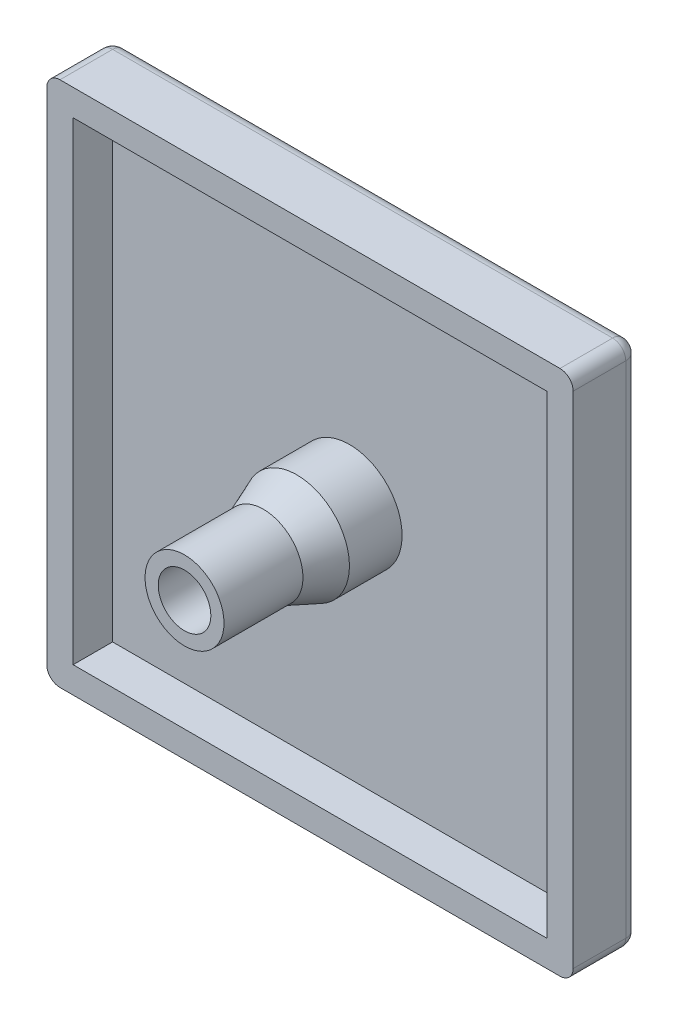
ISO-10303-21;
HEADER;
FILE_DESCRIPTION(('STEP AP214'),'2;1');
FILE_NAME('part.step','',(''),(''),'','','');
FILE_SCHEMA(('AUTOMOTIVE_DESIGN { 1 0 10303 214 1 1 1 1 }'));
ENDSEC;
DATA;
#1=APPLICATION_CONTEXT('core data for automotive mechanical design processes');
#2=APPLICATION_PROTOCOL_DEFINITION('international standard','automotive_design',2000,#1);
#3=PRODUCT_CONTEXT('',#1,'mechanical');
#4=PRODUCT('Part','Part','',(#3));
#5=PRODUCT_RELATED_PRODUCT_CATEGORY('part','',(#4));
#6=PRODUCT_DEFINITION_FORMATION('','',#4);
#7=PRODUCT_DEFINITION_CONTEXT('part definition',#1,'design');
#8=PRODUCT_DEFINITION('design','',#6,#7);
#9=PRODUCT_DEFINITION_SHAPE('','',#8);
#10=(LENGTH_UNIT() NAMED_UNIT(*) SI_UNIT(.MILLI.,.METRE.));
#11=(NAMED_UNIT(*) PLANE_ANGLE_UNIT() SI_UNIT($,.RADIAN.));
#12=(NAMED_UNIT(*) SI_UNIT($,.STERADIAN.) SOLID_ANGLE_UNIT());
#13=UNCERTAINTY_MEASURE_WITH_UNIT(LENGTH_MEASURE(1.E-05),#10,'distance_accuracy_value','');
#14=(GEOMETRIC_REPRESENTATION_CONTEXT(3) GLOBAL_UNCERTAINTY_ASSIGNED_CONTEXT((#13)) GLOBAL_UNIT_ASSIGNED_CONTEXT((#10,
#11,#12)) REPRESENTATION_CONTEXT('',''));
#15=CARTESIAN_POINT('',(0.,0.,0.));
#16=DIRECTION('',(0.,0.,1.));
#17=DIRECTION('',(1.,0.,0.));
#18=AXIS2_PLACEMENT_3D('',#15,#16,#17);
#19=CARTESIAN_POINT('',(-10.,10.,1.25));
#20=DIRECTION('',(1.,0.,0.));
#21=DIRECTION('',(0.,0.,-1.));
#22=AXIS2_PLACEMENT_3D('',#19,#20,#21);
#23=PLANE('',#22);
#24=DIRECTION('',(0.,-1.,0.));
#25=VECTOR('',#24,1.);
#26=CARTESIAN_POINT('',(-10.,10.,1.25));
#27=LINE('',#26,#25);
#28=CARTESIAN_POINT('',(-10.,9.5,1.25));
#29=VERTEX_POINT('',#28);
#30=CARTESIAN_POINT('',(-10.,-9.5,1.25));
#31=VERTEX_POINT('',#30);
#32=EDGE_CURVE('E178',#29,#31,#27,.T.);
#33=ORIENTED_EDGE('',*,*,#32,.F.);
#34=DIRECTION('',(0.,0.,-1.));
#35=VECTOR('',#34,1.);
#36=CARTESIAN_POINT('',(-10.,9.5,1.25));
#37=LINE('',#36,#35);
#38=CARTESIAN_POINT('',(-10.,9.5,-0.75));
#39=VERTEX_POINT('',#38);
#40=EDGE_CURVE('E211',#29,#39,#37,.T.);
#41=ORIENTED_EDGE('',*,*,#40,.T.);
#42=DIRECTION('',(0.,-1.,0.));
#43=VECTOR('',#42,1.);
#44=CARTESIAN_POINT('',(-10.,10.,-0.75));
#45=LINE('',#44,#43);
#46=CARTESIAN_POINT('',(-10.,-9.5,-0.75));
#47=VERTEX_POINT('',#46);
#48=EDGE_CURVE('E209',#39,#47,#45,.T.);
#49=ORIENTED_EDGE('',*,*,#48,.T.);
#50=DIRECTION('',(0.,0.,-1.));
#51=VECTOR('',#50,1.);
#52=CARTESIAN_POINT('',(-10.,-9.5,1.25));
#53=LINE('',#52,#51);
#54=EDGE_CURVE('E207',#47,#31,#53,.F.);
#55=ORIENTED_EDGE('',*,*,#54,.T.);
#56=EDGE_LOOP('',(#33,#41,#49,#55));
#57=FACE_BOUND('',#56,.T.);
#58=ADVANCED_FACE('F33',(#57),#23,.F.);
#59=CARTESIAN_POINT('',(-10.,-10.,1.25));
#60=DIRECTION('',(0.,1.,0.));
#61=DIRECTION('',(0.,0.,1.));
#62=AXIS2_PLACEMENT_3D('',#59,#60,#61);
#63=PLANE('',#62);
#64=DIRECTION('',(1.,0.,0.));
#65=VECTOR('',#64,1.);
#66=CARTESIAN_POINT('',(-10.,-10.,1.25));
#67=LINE('',#66,#65);
#68=CARTESIAN_POINT('',(-9.5,-10.,1.25));
#69=VERTEX_POINT('',#68);
#70=CARTESIAN_POINT('',(9.5,-10.,1.25));
#71=VERTEX_POINT('',#70);
#72=EDGE_CURVE('E181',#69,#71,#67,.T.);
#73=ORIENTED_EDGE('',*,*,#72,.F.);
#74=DIRECTION('',(0.,0.,-1.));
#75=VECTOR('',#74,1.);
#76=CARTESIAN_POINT('',(-9.5,-10.,1.25));
#77=LINE('',#76,#75);
#78=CARTESIAN_POINT('',(-9.5,-10.,-0.75));
#79=VERTEX_POINT('',#78);
#80=EDGE_CURVE('E225',#69,#79,#77,.T.);
#81=ORIENTED_EDGE('',*,*,#80,.T.);
#82=DIRECTION('',(1.,0.,0.));
#83=VECTOR('',#82,1.);
#84=CARTESIAN_POINT('',(-10.,-10.,-0.75));
#85=LINE('',#84,#83);
#86=CARTESIAN_POINT('',(9.5,-10.,-0.75));
#87=VERTEX_POINT('',#86);
#88=EDGE_CURVE('E221',#79,#87,#85,.T.);
#89=ORIENTED_EDGE('',*,*,#88,.T.);
#90=DIRECTION('',(0.,0.,-1.));
#91=VECTOR('',#90,1.);
#92=CARTESIAN_POINT('',(9.5,-10.,1.25));
#93=LINE('',#92,#91);
#94=EDGE_CURVE('E223',#87,#71,#93,.F.);
#95=ORIENTED_EDGE('',*,*,#94,.T.);
#96=EDGE_LOOP('',(#73,#81,#89,#95));
#97=FACE_BOUND('',#96,.T.);
#98=ADVANCED_FACE('F318',(#97),#63,.F.);
#99=CARTESIAN_POINT('',(10.,10.,1.25));
#100=DIRECTION('',(-1.,0.,0.));
#101=DIRECTION('',(0.,-1.,0.));
#102=AXIS2_PLACEMENT_3D('',#99,#100,#101);
#103=PLANE('',#102);
#104=DIRECTION('',(0.,1.,0.));
#105=VECTOR('',#104,1.);
#106=CARTESIAN_POINT('',(10.,10.,1.25));
#107=LINE('',#106,#105);
#108=CARTESIAN_POINT('',(10.,-9.5,1.25));
#109=VERTEX_POINT('',#108);
#110=CARTESIAN_POINT('',(10.,9.5,1.25));
#111=VERTEX_POINT('',#110);
#112=EDGE_CURVE('E185',#109,#111,#107,.T.);
#113=ORIENTED_EDGE('',*,*,#112,.F.);
#114=DIRECTION('',(0.,0.,-1.));
#115=VECTOR('',#114,1.);
#116=CARTESIAN_POINT('',(10.,-9.5,1.25));
#117=LINE('',#116,#115);
#118=CARTESIAN_POINT('',(10.,-9.5,-0.75));
#119=VERTEX_POINT('',#118);
#120=EDGE_CURVE('E41',#109,#119,#117,.T.);
#121=ORIENTED_EDGE('',*,*,#120,.T.);
#122=DIRECTION('',(0.,1.,0.));
#123=VECTOR('',#122,1.);
#124=CARTESIAN_POINT('',(10.,10.,-0.75));
#125=LINE('',#124,#123);
#126=CARTESIAN_POINT('',(10.,9.5,-0.75));
#127=VERTEX_POINT('',#126);
#128=EDGE_CURVE('E229',#119,#127,#125,.T.);
#129=ORIENTED_EDGE('',*,*,#128,.T.);
#130=DIRECTION('',(0.,0.,-1.));
#131=VECTOR('',#130,1.);
#132=CARTESIAN_POINT('',(10.,9.5,1.25));
#133=LINE('',#132,#131);
#134=EDGE_CURVE('E227',#127,#111,#133,.F.);
#135=ORIENTED_EDGE('',*,*,#134,.T.);
#136=EDGE_LOOP('',(#113,#121,#129,#135));
#137=FACE_BOUND('',#136,.T.);
#138=ADVANCED_FACE('F275',(#137),#103,.F.);
#139=CARTESIAN_POINT('',(-10.,10.,1.25));
#140=DIRECTION('',(0.,-1.,0.));
#141=DIRECTION('',(1.,0.,0.));
#142=AXIS2_PLACEMENT_3D('',#139,#140,#141);
#143=PLANE('',#142);
#144=DIRECTION('',(-1.,0.,0.));
#145=VECTOR('',#144,1.);
#146=CARTESIAN_POINT('',(-10.,10.,-0.75));
#147=LINE('',#146,#145);
#148=CARTESIAN_POINT('',(9.5,10.,-0.75));
#149=VERTEX_POINT('',#148);
#150=CARTESIAN_POINT('',(-9.5,10.,-0.75));
#151=VERTEX_POINT('',#150);
#152=EDGE_CURVE('E193',#149,#151,#147,.T.);
#153=ORIENTED_EDGE('',*,*,#152,.T.);
#154=DIRECTION('',(0.,0.,-1.));
#155=VECTOR('',#154,1.);
#156=CARTESIAN_POINT('',(-9.5,10.,1.25));
#157=LINE('',#156,#155);
#158=CARTESIAN_POINT('',(-9.5,10.,1.25));
#159=VERTEX_POINT('',#158);
#160=EDGE_CURVE('E196',#151,#159,#157,.F.);
#161=ORIENTED_EDGE('',*,*,#160,.T.);
#162=DIRECTION('',(-1.,0.,0.));
#163=VECTOR('',#162,1.);
#164=CARTESIAN_POINT('',(-10.,10.,1.25));
#165=LINE('',#164,#163);
#166=CARTESIAN_POINT('',(9.5,10.,1.25));
#167=VERTEX_POINT('',#166);
#168=EDGE_CURVE('E188',#167,#159,#165,.T.);
#169=ORIENTED_EDGE('',*,*,#168,.F.);
#170=DIRECTION('',(0.,0.,-1.));
#171=VECTOR('',#170,1.);
#172=CARTESIAN_POINT('',(9.5,10.,1.25));
#173=LINE('',#172,#171);
#174=EDGE_CURVE('E191',#167,#149,#173,.T.);
#175=ORIENTED_EDGE('',*,*,#174,.T.);
#176=EDGE_LOOP('',(#153,#161,#169,#175));
#177=FACE_BOUND('',#176,.T.);
#178=ADVANCED_FACE('F287',(#177),#143,.F.);
#179=CARTESIAN_POINT('',(0.,0.,1.25));
#180=DIRECTION('',(0.,0.,1.));
#181=DIRECTION('',(1.,0.,0.));
#182=AXIS2_PLACEMENT_3D('',#179,#180,#181);
#183=PLANE('',#182);
#184=DIRECTION('',(-1.,0.,0.));
#185=VECTOR('',#184,1.);
#186=CARTESIAN_POINT('',(-10.,9.,1.25));
#187=LINE('',#186,#185);
#188=CARTESIAN_POINT('',(9.,9.,1.25));
#189=VERTEX_POINT('',#188);
#190=CARTESIAN_POINT('',(-9.,9.,1.25));
#191=VERTEX_POINT('',#190);
#192=EDGE_CURVE('E156',#189,#191,#187,.T.);
#193=ORIENTED_EDGE('',*,*,#192,.F.);
#194=DIRECTION('',(0.,1.,0.));
#195=VECTOR('',#194,1.);
#196=CARTESIAN_POINT('',(9.,10.,1.25));
#197=LINE('',#196,#195);
#198=CARTESIAN_POINT('',(9.,-9.,1.25));
#199=VERTEX_POINT('',#198);
#200=EDGE_CURVE('E160',#199,#189,#197,.T.);
#201=ORIENTED_EDGE('',*,*,#200,.F.);
#202=DIRECTION('',(1.,0.,0.));
#203=VECTOR('',#202,1.);
#204=CARTESIAN_POINT('',(-10.,-9.,1.25));
#205=LINE('',#204,#203);
#206=CARTESIAN_POINT('',(-9.,-9.,1.25));
#207=VERTEX_POINT('',#206);
#208=EDGE_CURVE('E48',#207,#199,#205,.T.);
#209=ORIENTED_EDGE('',*,*,#208,.F.);
#210=DIRECTION('',(0.,-1.,0.));
#211=VECTOR('',#210,1.);
#212=CARTESIAN_POINT('',(-9.,10.,1.25));
#213=LINE('',#212,#211);
#214=EDGE_CURVE('E173',#191,#207,#213,.T.);
#215=ORIENTED_EDGE('',*,*,#214,.F.);
#216=EDGE_LOOP('',(#193,#201,#209,#215));
#217=FACE_BOUND('',#216,.T.);
#218=ORIENTED_EDGE('',*,*,#168,.T.);
#219=CARTESIAN_POINT('',(-9.5,9.5,1.25));
#220=DIRECTION('',(0.,0.,1.));
#221=DIRECTION('',(1.,0.,0.));
#222=AXIS2_PLACEMENT_3D('',#219,#220,#221);
#223=CIRCLE('',#222,0.5);
#224=EDGE_CURVE('E219',#159,#29,#223,.T.);
#225=ORIENTED_EDGE('',*,*,#224,.T.);
#226=ORIENTED_EDGE('',*,*,#32,.T.);
#227=CARTESIAN_POINT('',(-9.5,-9.5,1.25));
#228=DIRECTION('',(0.,0.,1.));
#229=DIRECTION('',(1.,0.,0.));
#230=AXIS2_PLACEMENT_3D('',#227,#228,#229);
#231=CIRCLE('',#230,0.5);
#232=EDGE_CURVE('E217',#31,#69,#231,.T.);
#233=ORIENTED_EDGE('',*,*,#232,.T.);
#234=ORIENTED_EDGE('',*,*,#72,.T.);
#235=CARTESIAN_POINT('',(9.5,-9.5,1.25));
#236=DIRECTION('',(0.,0.,1.));
#237=DIRECTION('',(1.,0.,0.));
#238=AXIS2_PLACEMENT_3D('',#235,#236,#237);
#239=CIRCLE('',#238,0.5);
#240=EDGE_CURVE('E215',#71,#109,#239,.T.);
#241=ORIENTED_EDGE('',*,*,#240,.T.);
#242=ORIENTED_EDGE('',*,*,#112,.T.);
#243=CARTESIAN_POINT('',(9.5,9.5,1.25));
#244=DIRECTION('',(0.,0.,1.));
#245=DIRECTION('',(1.,0.,0.));
#246=AXIS2_PLACEMENT_3D('',#243,#244,#245);
#247=CIRCLE('',#246,0.5);
#248=EDGE_CURVE('E213',#111,#167,#247,.T.);
#249=ORIENTED_EDGE('',*,*,#248,.T.);
#250=EDGE_LOOP('',(#218,#225,#226,#233,#234,#241,#242,#249));
#251=FACE_BOUND('',#250,.T.);
#252=ADVANCED_FACE('F284',(#217,#251),#183,.T.);
#253=CARTESIAN_POINT('',(0.,0.,-1.25));
#254=DIRECTION('',(0.,0.,1.));
#255=DIRECTION('',(1.,0.,0.));
#256=AXIS2_PLACEMENT_3D('',#253,#254,#255);
#257=PLANE('',#256);
#258=DIRECTION('',(0.,-1.,0.));
#259=VECTOR('',#258,1.);
#260=CARTESIAN_POINT('',(-9.5,0.,-1.25));
#261=LINE('',#260,#259);
#262=CARTESIAN_POINT('',(-9.5,-9.5,-1.25));
#263=VERTEX_POINT('',#262);
#264=CARTESIAN_POINT('',(-9.5,9.5,-1.25));
#265=VERTEX_POINT('',#264);
#266=EDGE_CURVE('E202',#263,#265,#261,.F.);
#267=ORIENTED_EDGE('',*,*,#266,.T.);
#268=DIRECTION('',(-1.,0.,0.));
#269=VECTOR('',#268,1.);
#270=CARTESIAN_POINT('',(0.,9.5,-1.25));
#271=LINE('',#270,#269);
#272=CARTESIAN_POINT('',(9.5,9.5,-1.25));
#273=VERTEX_POINT('',#272);
#274=EDGE_CURVE('E204',#265,#273,#271,.F.);
#275=ORIENTED_EDGE('',*,*,#274,.T.);
#276=DIRECTION('',(0.,1.,0.));
#277=VECTOR('',#276,1.);
#278=CARTESIAN_POINT('',(9.5,0.,-1.25));
#279=LINE('',#278,#277);
#280=CARTESIAN_POINT('',(9.5,-9.5,-1.25));
#281=VERTEX_POINT('',#280);
#282=EDGE_CURVE('E198',#273,#281,#279,.F.);
#283=ORIENTED_EDGE('',*,*,#282,.T.);
#284=DIRECTION('',(1.,0.,0.));
#285=VECTOR('',#284,1.);
#286=CARTESIAN_POINT('',(0.,-9.5,-1.25));
#287=LINE('',#286,#285);
#288=EDGE_CURVE('E200',#281,#263,#287,.F.);
#289=ORIENTED_EDGE('',*,*,#288,.T.);
#290=EDGE_LOOP('',(#267,#275,#283,#289));
#291=FACE_BOUND('',#290,.T.);
#292=ADVANCED_FACE('F313',(#291),#257,.F.);
#293=CARTESIAN_POINT('',(9.5,-9.5,1.25));
#294=DIRECTION('',(0.,0.,-1.));
#295=DIRECTION('',(-1.,0.,0.));
#296=AXIS2_PLACEMENT_3D('',#293,#294,#295);
#297=CYLINDRICAL_SURFACE('',#296,0.5);
#298=ORIENTED_EDGE('',*,*,#240,.F.);
#299=ORIENTED_EDGE('',*,*,#94,.F.);
#300=CARTESIAN_POINT('',(9.5,-9.5,-0.75));
#301=DIRECTION('',(0.,0.,-1.));
#302=DIRECTION('',(-1.,0.,0.));
#303=AXIS2_PLACEMENT_3D('',#300,#301,#302);
#304=CIRCLE('',#303,0.5);
#305=EDGE_CURVE('E259',#119,#87,#304,.T.);
#306=ORIENTED_EDGE('',*,*,#305,.F.);
#307=ORIENTED_EDGE('',*,*,#120,.F.);
#308=EDGE_LOOP('',(#298,#299,#306,#307));
#309=FACE_BOUND('',#308,.T.);
#310=ADVANCED_FACE('F35',(#309),#297,.T.);
#311=CARTESIAN_POINT('',(-9.5,-9.5,1.25));
#312=DIRECTION('',(0.,0.,-1.));
#313=DIRECTION('',(-1.,0.,0.));
#314=AXIS2_PLACEMENT_3D('',#311,#312,#313);
#315=CYLINDRICAL_SURFACE('',#314,0.5);
#316=ORIENTED_EDGE('',*,*,#232,.F.);
#317=ORIENTED_EDGE('',*,*,#54,.F.);
#318=CARTESIAN_POINT('',(-9.5,-9.5,-0.75));
#319=DIRECTION('',(0.,0.,-1.));
#320=DIRECTION('',(-1.,0.,0.));
#321=AXIS2_PLACEMENT_3D('',#318,#319,#320);
#322=CIRCLE('',#321,0.5);
#323=EDGE_CURVE('E256',#79,#47,#322,.T.);
#324=ORIENTED_EDGE('',*,*,#323,.F.);
#325=ORIENTED_EDGE('',*,*,#80,.F.);
#326=EDGE_LOOP('',(#316,#317,#324,#325));
#327=FACE_BOUND('',#326,.T.);
#328=ADVANCED_FACE('F301',(#327),#315,.T.);
#329=CARTESIAN_POINT('',(-10.,-9.5,-0.75));
#330=DIRECTION('',(1.,0.,0.));
#331=DIRECTION('',(0.,0.,-1.));
#332=AXIS2_PLACEMENT_3D('',#329,#330,#331);
#333=CYLINDRICAL_SURFACE('',#332,0.5);
#334=CARTESIAN_POINT('',(9.5,-9.5,-0.75));
#335=DIRECTION('',(1.,0.,0.));
#336=DIRECTION('',(0.,0.,-1.));
#337=AXIS2_PLACEMENT_3D('',#334,#335,#336);
#338=CIRCLE('',#337,0.5);
#339=EDGE_CURVE('E182',#87,#281,#338,.T.);
#340=ORIENTED_EDGE('',*,*,#339,.F.);
#341=ORIENTED_EDGE('',*,*,#88,.F.);
#342=CARTESIAN_POINT('',(-9.5,-9.5,-0.75));
#343=DIRECTION('',(-1.,0.,0.));
#344=DIRECTION('',(0.,0.,1.));
#345=AXIS2_PLACEMENT_3D('',#342,#343,#344);
#346=CIRCLE('',#345,0.5);
#347=EDGE_CURVE('E253',#263,#79,#346,.T.);
#348=ORIENTED_EDGE('',*,*,#347,.F.);
#349=ORIENTED_EDGE('',*,*,#288,.F.);
#350=EDGE_LOOP('',(#340,#341,#348,#349));
#351=FACE_BOUND('',#350,.T.);
#352=ADVANCED_FACE('F314',(#351),#333,.T.);
#353=CARTESIAN_POINT('',(9.5,-9.5,-0.75));
#354=DIRECTION('',(0.,0.,1.));
#355=DIRECTION('',(1.,0.,0.));
#356=AXIS2_PLACEMENT_3D('',#353,#354,#355);
#357=SPHERICAL_SURFACE('',#356,0.5);
#358=ORIENTED_EDGE('',*,*,#305,.T.);
#359=ORIENTED_EDGE('',*,*,#339,.T.);
#360=CARTESIAN_POINT('',(9.5,-9.5,-0.75));
#361=DIRECTION('',(0.,-1.,0.));
#362=DIRECTION('',(1.,0.,0.));
#363=AXIS2_PLACEMENT_3D('',#360,#361,#362);
#364=CIRCLE('',#363,0.5);
#365=EDGE_CURVE('E250',#119,#281,#364,.F.);
#366=ORIENTED_EDGE('',*,*,#365,.F.);
#367=EDGE_LOOP('',(#358,#359,#366));
#368=FACE_BOUND('',#367,.T.);
#369=ADVANCED_FACE('F265',(#368),#357,.T.);
#370=CARTESIAN_POINT('',(-9.5,-9.5,-0.75));
#371=DIRECTION('',(0.,0.,1.));
#372=DIRECTION('',(1.,0.,0.));
#373=AXIS2_PLACEMENT_3D('',#370,#371,#372);
#374=SPHERICAL_SURFACE('',#373,0.5);
#375=ORIENTED_EDGE('',*,*,#347,.T.);
#376=ORIENTED_EDGE('',*,*,#323,.T.);
#377=CARTESIAN_POINT('',(-9.5,-9.5,-0.75));
#378=DIRECTION('',(0.,-1.,0.));
#379=DIRECTION('',(0.,0.,-1.));
#380=AXIS2_PLACEMENT_3D('',#377,#378,#379);
#381=CIRCLE('',#380,0.5);
#382=EDGE_CURVE('E247',#263,#47,#381,.F.);
#383=ORIENTED_EDGE('',*,*,#382,.F.);
#384=EDGE_LOOP('',(#375,#376,#383));
#385=FACE_BOUND('',#384,.T.);
#386=ADVANCED_FACE('F305',(#385),#374,.T.);
#387=CARTESIAN_POINT('',(9.5,10.,-0.75));
#388=DIRECTION('',(0.,1.,0.));
#389=DIRECTION('',(-1.,0.,0.));
#390=AXIS2_PLACEMENT_3D('',#387,#388,#389);
#391=CYLINDRICAL_SURFACE('',#390,0.5);
#392=ORIENTED_EDGE('',*,*,#365,.T.);
#393=ORIENTED_EDGE('',*,*,#282,.F.);
#394=CARTESIAN_POINT('',(9.5,9.5,-0.75));
#395=DIRECTION('',(0.,1.,0.));
#396=DIRECTION('',(0.,0.,1.));
#397=AXIS2_PLACEMENT_3D('',#394,#395,#396);
#398=CIRCLE('',#397,0.5);
#399=EDGE_CURVE('E244',#127,#273,#398,.T.);
#400=ORIENTED_EDGE('',*,*,#399,.F.);
#401=ORIENTED_EDGE('',*,*,#128,.F.);
#402=EDGE_LOOP('',(#392,#393,#400,#401));
#403=FACE_BOUND('',#402,.T.);
#404=ADVANCED_FACE('F272',(#403),#391,.T.);
#405=CARTESIAN_POINT('',(9.5,9.5,1.25));
#406=DIRECTION('',(0.,0.,-1.));
#407=DIRECTION('',(-1.,0.,0.));
#408=AXIS2_PLACEMENT_3D('',#405,#406,#407);
#409=CYLINDRICAL_SURFACE('',#408,0.5);
#410=ORIENTED_EDGE('',*,*,#248,.F.);
#411=ORIENTED_EDGE('',*,*,#134,.F.);
#412=CARTESIAN_POINT('',(9.5,9.5,-0.75));
#413=DIRECTION('',(0.,0.,-1.));
#414=DIRECTION('',(-1.,0.,0.));
#415=AXIS2_PLACEMENT_3D('',#412,#413,#414);
#416=CIRCLE('',#415,0.5);
#417=EDGE_CURVE('E241',#149,#127,#416,.T.);
#418=ORIENTED_EDGE('',*,*,#417,.F.);
#419=ORIENTED_EDGE('',*,*,#174,.F.);
#420=EDGE_LOOP('',(#410,#411,#418,#419));
#421=FACE_BOUND('',#420,.T.);
#422=ADVANCED_FACE('F279',(#421),#409,.T.);
#423=CARTESIAN_POINT('',(-9.5,9.5,1.25));
#424=DIRECTION('',(0.,0.,-1.));
#425=DIRECTION('',(-1.,0.,0.));
#426=AXIS2_PLACEMENT_3D('',#423,#424,#425);
#427=CYLINDRICAL_SURFACE('',#426,0.5);
#428=ORIENTED_EDGE('',*,*,#224,.F.);
#429=ORIENTED_EDGE('',*,*,#160,.F.);
#430=CARTESIAN_POINT('',(-9.5,9.5,-0.75));
#431=DIRECTION('',(0.,0.,-1.));
#432=DIRECTION('',(-1.,0.,0.));
#433=AXIS2_PLACEMENT_3D('',#430,#431,#432);
#434=CIRCLE('',#433,0.5);
#435=EDGE_CURVE('E238',#39,#151,#434,.T.);
#436=ORIENTED_EDGE('',*,*,#435,.F.);
#437=ORIENTED_EDGE('',*,*,#40,.F.);
#438=EDGE_LOOP('',(#428,#429,#436,#437));
#439=FACE_BOUND('',#438,.T.);
#440=ADVANCED_FACE('F292',(#439),#427,.T.);
#441=CARTESIAN_POINT('',(-9.5,10.,-0.75));
#442=DIRECTION('',(0.,-1.,0.));
#443=DIRECTION('',(0.,0.,-1.));
#444=AXIS2_PLACEMENT_3D('',#441,#442,#443);
#445=CYLINDRICAL_SURFACE('',#444,0.5);
#446=ORIENTED_EDGE('',*,*,#382,.T.);
#447=ORIENTED_EDGE('',*,*,#48,.F.);
#448=CARTESIAN_POINT('',(-9.5,9.5,-0.75));
#449=DIRECTION('',(0.,1.,0.));
#450=DIRECTION('',(0.,0.,1.));
#451=AXIS2_PLACEMENT_3D('',#448,#449,#450);
#452=CIRCLE('',#451,0.5);
#453=EDGE_CURVE('E235',#265,#39,#452,.T.);
#454=ORIENTED_EDGE('',*,*,#453,.F.);
#455=ORIENTED_EDGE('',*,*,#266,.F.);
#456=EDGE_LOOP('',(#446,#447,#454,#455));
#457=FACE_BOUND('',#456,.T.);
#458=ADVANCED_FACE('F309',(#457),#445,.T.);
#459=CARTESIAN_POINT('',(9.5,9.5,-0.75));
#460=DIRECTION('',(0.,0.,1.));
#461=DIRECTION('',(1.,0.,0.));
#462=AXIS2_PLACEMENT_3D('',#459,#460,#461);
#463=SPHERICAL_SURFACE('',#462,0.5);
#464=ORIENTED_EDGE('',*,*,#417,.T.);
#465=ORIENTED_EDGE('',*,*,#399,.T.);
#466=CARTESIAN_POINT('',(9.5,9.5,-0.75));
#467=DIRECTION('',(1.,0.,0.));
#468=DIRECTION('',(0.,0.,-1.));
#469=AXIS2_PLACEMENT_3D('',#466,#467,#468);
#470=CIRCLE('',#469,0.5);
#471=EDGE_CURVE('E233',#149,#273,#470,.F.);
#472=ORIENTED_EDGE('',*,*,#471,.F.);
#473=EDGE_LOOP('',(#464,#465,#472));
#474=FACE_BOUND('',#473,.T.);
#475=ADVANCED_FACE('F342',(#474),#463,.T.);
#476=CARTESIAN_POINT('',(-9.5,9.5,-0.75));
#477=DIRECTION('',(0.,0.,1.));
#478=DIRECTION('',(1.,0.,0.));
#479=AXIS2_PLACEMENT_3D('',#476,#477,#478);
#480=SPHERICAL_SURFACE('',#479,0.5);
#481=ORIENTED_EDGE('',*,*,#453,.T.);
#482=ORIENTED_EDGE('',*,*,#435,.T.);
#483=CARTESIAN_POINT('',(-9.5,9.5,-0.75));
#484=DIRECTION('',(-1.,0.,0.));
#485=DIRECTION('',(0.,0.,1.));
#486=AXIS2_PLACEMENT_3D('',#483,#484,#485);
#487=CIRCLE('',#486,0.5);
#488=EDGE_CURVE('E171',#265,#151,#487,.F.);
#489=ORIENTED_EDGE('',*,*,#488,.F.);
#490=EDGE_LOOP('',(#481,#482,#489));
#491=FACE_BOUND('',#490,.T.);
#492=ADVANCED_FACE('F338',(#491),#480,.T.);
#493=CARTESIAN_POINT('',(-10.,9.5,-0.75));
#494=DIRECTION('',(-1.,0.,0.));
#495=DIRECTION('',(0.,-1.,0.));
#496=AXIS2_PLACEMENT_3D('',#493,#494,#495);
#497=CYLINDRICAL_SURFACE('',#496,0.5);
#498=ORIENTED_EDGE('',*,*,#471,.T.);
#499=ORIENTED_EDGE('',*,*,#274,.F.);
#500=ORIENTED_EDGE('',*,*,#488,.T.);
#501=ORIENTED_EDGE('',*,*,#152,.F.);
#502=EDGE_LOOP('',(#498,#499,#500,#501));
#503=FACE_BOUND('',#502,.T.);
#504=ADVANCED_FACE('F335',(#503),#497,.T.);
#505=CARTESIAN_POINT('',(-9.,10.,1.25));
#506=DIRECTION('',(1.,0.,0.));
#507=DIRECTION('',(0.,0.,-1.));
#508=AXIS2_PLACEMENT_3D('',#505,#506,#507);
#509=PLANE('',#508);
#510=ORIENTED_EDGE('',*,*,#214,.T.);
#511=DIRECTION('',(0.,0.,1.));
#512=VECTOR('',#511,1.);
#513=CARTESIAN_POINT('',(-9.,-9.,1.25));
#514=LINE('',#513,#512);
#515=CARTESIAN_POINT('',(-9.,-9.,-0.25));
#516=VERTEX_POINT('',#515);
#517=EDGE_CURVE('E141',#516,#207,#514,.T.);
#518=ORIENTED_EDGE('',*,*,#517,.F.);
#519=DIRECTION('',(0.,-1.,0.));
#520=VECTOR('',#519,1.);
#521=CARTESIAN_POINT('',(-9.,10.,-0.25));
#522=LINE('',#521,#520);
#523=CARTESIAN_POINT('',(-9.,9.,-0.25));
#524=VERTEX_POINT('',#523);
#525=EDGE_CURVE('E134',#524,#516,#522,.T.);
#526=ORIENTED_EDGE('',*,*,#525,.F.);
#527=DIRECTION('',(0.,0.,1.));
#528=VECTOR('',#527,1.);
#529=CARTESIAN_POINT('',(-9.,9.,1.25));
#530=LINE('',#529,#528);
#531=EDGE_CURVE('E139',#524,#191,#530,.T.);
#532=ORIENTED_EDGE('',*,*,#531,.T.);
#533=EDGE_LOOP('',(#510,#518,#526,#532));
#534=FACE_BOUND('',#533,.T.);
#535=ADVANCED_FACE('F137',(#534),#509,.T.);
#536=CARTESIAN_POINT('',(-10.,-9.,1.25));
#537=DIRECTION('',(0.,1.,0.));
#538=DIRECTION('',(0.,0.,1.));
#539=AXIS2_PLACEMENT_3D('',#536,#537,#538);
#540=PLANE('',#539);
#541=ORIENTED_EDGE('',*,*,#208,.T.);
#542=DIRECTION('',(0.,0.,1.));
#543=VECTOR('',#542,1.);
#544=CARTESIAN_POINT('',(9.,-9.,1.25));
#545=LINE('',#544,#543);
#546=CARTESIAN_POINT('',(9.,-9.,-0.25));
#547=VERTEX_POINT('',#546);
#548=EDGE_CURVE('E168',#547,#199,#545,.T.);
#549=ORIENTED_EDGE('',*,*,#548,.F.);
#550=DIRECTION('',(1.,0.,0.));
#551=VECTOR('',#550,1.);
#552=CARTESIAN_POINT('',(-10.,-9.,-0.25));
#553=LINE('',#552,#551);
#554=EDGE_CURVE('E144',#516,#547,#553,.T.);
#555=ORIENTED_EDGE('',*,*,#554,.F.);
#556=ORIENTED_EDGE('',*,*,#517,.T.);
#557=EDGE_LOOP('',(#541,#549,#555,#556));
#558=FACE_BOUND('',#557,.T.);
#559=ADVANCED_FACE('F407',(#558),#540,.T.);
#560=CARTESIAN_POINT('',(9.,10.,1.25));
#561=DIRECTION('',(-1.,0.,0.));
#562=DIRECTION('',(0.,-1.,0.));
#563=AXIS2_PLACEMENT_3D('',#560,#561,#562);
#564=PLANE('',#563);
#565=ORIENTED_EDGE('',*,*,#200,.T.);
#566=DIRECTION('',(0.,0.,1.));
#567=VECTOR('',#566,1.);
#568=CARTESIAN_POINT('',(9.,9.,1.25));
#569=LINE('',#568,#567);
#570=CARTESIAN_POINT('',(9.,9.,-0.25));
#571=VERTEX_POINT('',#570);
#572=EDGE_CURVE('E169',#571,#189,#569,.T.);
#573=ORIENTED_EDGE('',*,*,#572,.F.);
#574=DIRECTION('',(0.,-1.,0.));
#575=VECTOR('',#574,1.);
#576=CARTESIAN_POINT('',(9.,0.,-0.25));
#577=LINE('',#576,#575);
#578=EDGE_CURVE('E151',#571,#547,#577,.T.);
#579=ORIENTED_EDGE('',*,*,#578,.T.);
#580=ORIENTED_EDGE('',*,*,#548,.T.);
#581=EDGE_LOOP('',(#565,#573,#579,#580));
#582=FACE_BOUND('',#581,.T.);
#583=ADVANCED_FACE('F414',(#582),#564,.T.);
#584=CARTESIAN_POINT('',(-10.,9.,1.25));
#585=DIRECTION('',(0.,-1.,0.));
#586=DIRECTION('',(1.,0.,0.));
#587=AXIS2_PLACEMENT_3D('',#584,#585,#586);
#588=PLANE('',#587);
#589=DIRECTION('',(1.,0.,0.));
#590=VECTOR('',#589,1.);
#591=CARTESIAN_POINT('',(0.,9.,-0.25));
#592=LINE('',#591,#590);
#593=EDGE_CURVE('E148',#524,#571,#592,.T.);
#594=ORIENTED_EDGE('',*,*,#593,.T.);
#595=ORIENTED_EDGE('',*,*,#572,.T.);
#596=ORIENTED_EDGE('',*,*,#192,.T.);
#597=ORIENTED_EDGE('',*,*,#531,.F.);
#598=EDGE_LOOP('',(#594,#595,#596,#597));
#599=FACE_BOUND('',#598,.T.);
#600=ADVANCED_FACE('F154',(#599),#588,.T.);
#601=CARTESIAN_POINT('',(0.,0.,-0.25));
#602=DIRECTION('',(0.,0.,1.));
#603=DIRECTION('',(1.,0.,0.));
#604=AXIS2_PLACEMENT_3D('',#601,#602,#603);
#605=PLANE('',#604);
#606=CARTESIAN_POINT('',(0.,0.,-0.25));
#607=DIRECTION('',(0.,0.,1.));
#608=DIRECTION('',(1.,0.,0.));
#609=AXIS2_PLACEMENT_3D('',#606,#607,#608);
#610=CIRCLE('',#609,2.);
#611=CARTESIAN_POINT('',(2.,0.,-0.25));
#612=VERTEX_POINT('',#611);
#613=EDGE_CURVE('E11',#612,#612,#610,.T.);
#614=ORIENTED_EDGE('',*,*,#613,.F.);
#615=EDGE_LOOP('',(#614));
#616=FACE_BOUND('',#615,.T.);
#617=ORIENTED_EDGE('',*,*,#525,.T.);
#618=ORIENTED_EDGE('',*,*,#554,.T.);
#619=ORIENTED_EDGE('',*,*,#578,.F.);
#620=ORIENTED_EDGE('',*,*,#593,.F.);
#621=EDGE_LOOP('',(#617,#618,#619,#620));
#622=FACE_BOUND('',#621,.T.);
#623=ADVANCED_FACE('F149',(#616,#622),#605,.T.);
#624=CARTESIAN_POINT('',(0.,0.,6.01669869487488));
#625=DIRECTION('',(0.,0.,1.));
#626=DIRECTION('',(1.,0.,0.));
#627=AXIS2_PLACEMENT_3D('',#624,#625,#626);
#628=CYLINDRICAL_SURFACE('',#627,2.);
#629=ORIENTED_EDGE('',*,*,#613,.T.);
#630=EDGE_LOOP('',(#629));
#631=FACE_BOUND('',#630,.T.);
#632=CARTESIAN_POINT('',(0.,0.,1.75));
#633=DIRECTION('',(0.,0.,1.));
#634=DIRECTION('',(1.,0.,0.));
#635=AXIS2_PLACEMENT_3D('',#632,#633,#634);
#636=CIRCLE('',#635,2.);
#637=CARTESIAN_POINT('',(2.,0.,1.75));
#638=VERTEX_POINT('',#637);
#639=EDGE_CURVE('E163',#638,#638,#636,.T.);
#640=ORIENTED_EDGE('',*,*,#639,.F.);
#641=EDGE_LOOP('',(#640));
#642=FACE_BOUND('',#641,.T.);
#643=ADVANCED_FACE('F434',(#631,#642),#628,.T.);
#644=CARTESIAN_POINT('',(0.,0.,3.01669869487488));
#645=DIRECTION('',(0.,0.,-1.));
#646=DIRECTION('',(-1.,0.,0.));
#647=AXIS2_PLACEMENT_3D('',#644,#645,#646);
#648=CONICAL_SURFACE('',#647,1.5,0.375952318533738);
#649=ORIENTED_EDGE('',*,*,#639,.T.);
#650=EDGE_LOOP('',(#649));
#651=FACE_BOUND('',#650,.T.);
#652=CARTESIAN_POINT('',(0.,0.,3.01669869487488));
#653=DIRECTION('',(0.,0.,1.));
#654=DIRECTION('',(1.,0.,0.));
#655=AXIS2_PLACEMENT_3D('',#652,#653,#654);
#656=CIRCLE('',#655,1.5);
#657=CARTESIAN_POINT('',(1.5,0.,3.01669869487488));
#658=VERTEX_POINT('',#657);
#659=EDGE_CURVE('E602',#658,#658,#656,.T.);
#660=ORIENTED_EDGE('',*,*,#659,.F.);
#661=EDGE_LOOP('',(#660));
#662=FACE_BOUND('',#661,.T.);
#663=ADVANCED_FACE('F442',(#651,#662),#648,.T.);
#664=CARTESIAN_POINT('',(0.,0.,6.01669869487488));
#665=DIRECTION('',(0.,0.,1.));
#666=DIRECTION('',(1.,0.,0.));
#667=AXIS2_PLACEMENT_3D('',#664,#665,#666);
#668=CYLINDRICAL_SURFACE('',#667,1.5);
#669=ORIENTED_EDGE('',*,*,#659,.T.);
#670=EDGE_LOOP('',(#669));
#671=FACE_BOUND('',#670,.T.);
#672=CARTESIAN_POINT('',(0.,0.,6.01669869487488));
#673=DIRECTION('',(0.,0.,1.));
#674=DIRECTION('',(1.,0.,0.));
#675=AXIS2_PLACEMENT_3D('',#672,#673,#674);
#676=CIRCLE('',#675,1.5);
#677=CARTESIAN_POINT('',(1.5,0.,6.01669869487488));
#678=VERTEX_POINT('',#677);
#679=EDGE_CURVE('E598',#678,#678,#676,.T.);
#680=ORIENTED_EDGE('',*,*,#679,.F.);
#681=EDGE_LOOP('',(#680));
#682=FACE_BOUND('',#681,.T.);
#683=ADVANCED_FACE('F450',(#671,#682),#668,.T.);
#684=CARTESIAN_POINT('',(1.5,0.,6.01669869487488));
#685=DIRECTION('',(0.,0.,1.));
#686=DIRECTION('',(1.,0.,0.));
#687=AXIS2_PLACEMENT_3D('',#684,#685,#686);
#688=PLANE('',#687);
#689=CARTESIAN_POINT('',(0.,0.,6.01669869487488));
#690=DIRECTION('',(0.,0.,1.));
#691=DIRECTION('',(1.,0.,0.));
#692=AXIS2_PLACEMENT_3D('',#689,#690,#691);
#693=CIRCLE('',#692,1.);
#694=CARTESIAN_POINT('',(1.,0.,6.01669869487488));
#695=VERTEX_POINT('',#694);
#696=EDGE_CURVE('E610',#695,#695,#693,.T.);
#697=ORIENTED_EDGE('',*,*,#696,.F.);
#698=EDGE_LOOP('',(#697));
#699=FACE_BOUND('',#698,.T.);
#700=ORIENTED_EDGE('',*,*,#679,.T.);
#701=EDGE_LOOP('',(#700));
#702=FACE_BOUND('',#701,.T.);
#703=ADVANCED_FACE('F458',(#699,#702),#688,.T.);
#704=CARTESIAN_POINT('',(0.,0.,6.01669869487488));
#705=DIRECTION('',(0.,0.,1.));
#706=DIRECTION('',(1.,0.,0.));
#707=AXIS2_PLACEMENT_3D('',#704,#705,#706);
#708=CYLINDRICAL_SURFACE('',#707,1.);
#709=CARTESIAN_POINT('',(0.,0.,2.92158771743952));
#710=DIRECTION('',(0.,0.,-1.));
#711=DIRECTION('',(-1.,0.,0.));
#712=AXIS2_PLACEMENT_3D('',#709,#710,#711);
#713=CIRCLE('',#712,1.);
#714=CARTESIAN_POINT('',(-1.,0.,2.92158771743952));
#715=VERTEX_POINT('',#714);
#716=EDGE_CURVE('E605',#715,#715,#713,.F.);
#717=ORIENTED_EDGE('',*,*,#716,.F.);
#718=EDGE_LOOP('',(#717));
#719=FACE_BOUND('',#718,.T.);
#720=ORIENTED_EDGE('',*,*,#696,.T.);
#721=EDGE_LOOP('',(#720));
#722=FACE_BOUND('',#721,.T.);
#723=ADVANCED_FACE('F466',(#719,#722),#708,.F.);
#724=CARTESIAN_POINT('',(0.,0.,2.83311944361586));
#725=DIRECTION('',(0.,0.,-1.));
#726=DIRECTION('',(-1.,0.,0.));
#727=AXIS2_PLACEMENT_3D('',#724,#725,#726);
#728=CONICAL_SURFACE('',#727,1.03492080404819,0.375952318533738);
#729=CARTESIAN_POINT('',(0.,0.,1.65488902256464));
#730=DIRECTION('',(0.,0.,-1.));
#731=DIRECTION('',(-1.,0.,0.));
#732=AXIS2_PLACEMENT_3D('',#729,#730,#731);
#733=CIRCLE('',#732,1.5);
#734=CARTESIAN_POINT('',(-1.5,0.,1.65488902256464));
#735=VERTEX_POINT('',#734);
#736=EDGE_CURVE('E599',#735,#735,#733,.F.);
#737=ORIENTED_EDGE('',*,*,#736,.F.);
#738=EDGE_LOOP('',(#737));
#739=FACE_BOUND('',#738,.T.);
#740=ORIENTED_EDGE('',*,*,#716,.T.);
#741=EDGE_LOOP('',(#740));
#742=FACE_BOUND('',#741,.T.);
#743=ADVANCED_FACE('F474',(#739,#742),#728,.F.);
#744=CARTESIAN_POINT('',(0.,0.,6.01669869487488));
#745=DIRECTION('',(0.,0.,1.));
#746=DIRECTION('',(1.,0.,0.));
#747=AXIS2_PLACEMENT_3D('',#744,#745,#746);
#748=CYLINDRICAL_SURFACE('',#747,1.5);
#749=CARTESIAN_POINT('',(0.,0.,-0.75));
#750=DIRECTION('',(0.,0.,1.));
#751=DIRECTION('',(1.,0.,0.));
#752=AXIS2_PLACEMENT_3D('',#749,#750,#751);
#753=CIRCLE('',#752,1.5);
#754=CARTESIAN_POINT('',(1.5,0.,-0.75));
#755=VERTEX_POINT('',#754);
#756=EDGE_CURVE('E597',#755,#755,#753,.T.);
#757=ORIENTED_EDGE('',*,*,#756,.F.);
#758=EDGE_LOOP('',(#757));
#759=FACE_BOUND('',#758,.T.);
#760=ORIENTED_EDGE('',*,*,#736,.T.);
#761=EDGE_LOOP('',(#760));
#762=FACE_BOUND('',#761,.T.);
#763=ADVANCED_FACE('F482',(#759,#762),#748,.F.);
#764=CARTESIAN_POINT('',(0.,0.,-0.75));
#765=DIRECTION('',(0.,0.,1.));
#766=DIRECTION('',(1.,0.,0.));
#767=AXIS2_PLACEMENT_3D('',#764,#765,#766);
#768=PLANE('',#767);
#769=ORIENTED_EDGE('',*,*,#756,.T.);
#770=EDGE_LOOP('',(#769));
#771=FACE_BOUND('',#770,.T.);
#772=ADVANCED_FACE('F490',(#771),#768,.T.);
#773=CLOSED_SHELL('',(#58,#98,#138,#178,#252,#292,#310,#328,#352,#369,#386,#404,#422,#440,#458,
#475,#492,#504,#535,#559,#583,#600,#623,#643,#663,#683,#703,#723,#743,#763,#772));
#774=MANIFOLD_SOLID_BREP('B2',#773);
#775=ADVANCED_BREP_SHAPE_REPRESENTATION('',(#18,#774),#14);
#776=SHAPE_DEFINITION_REPRESENTATION(#9,#775);
ENDSEC;
END-ISO-10303-21;
